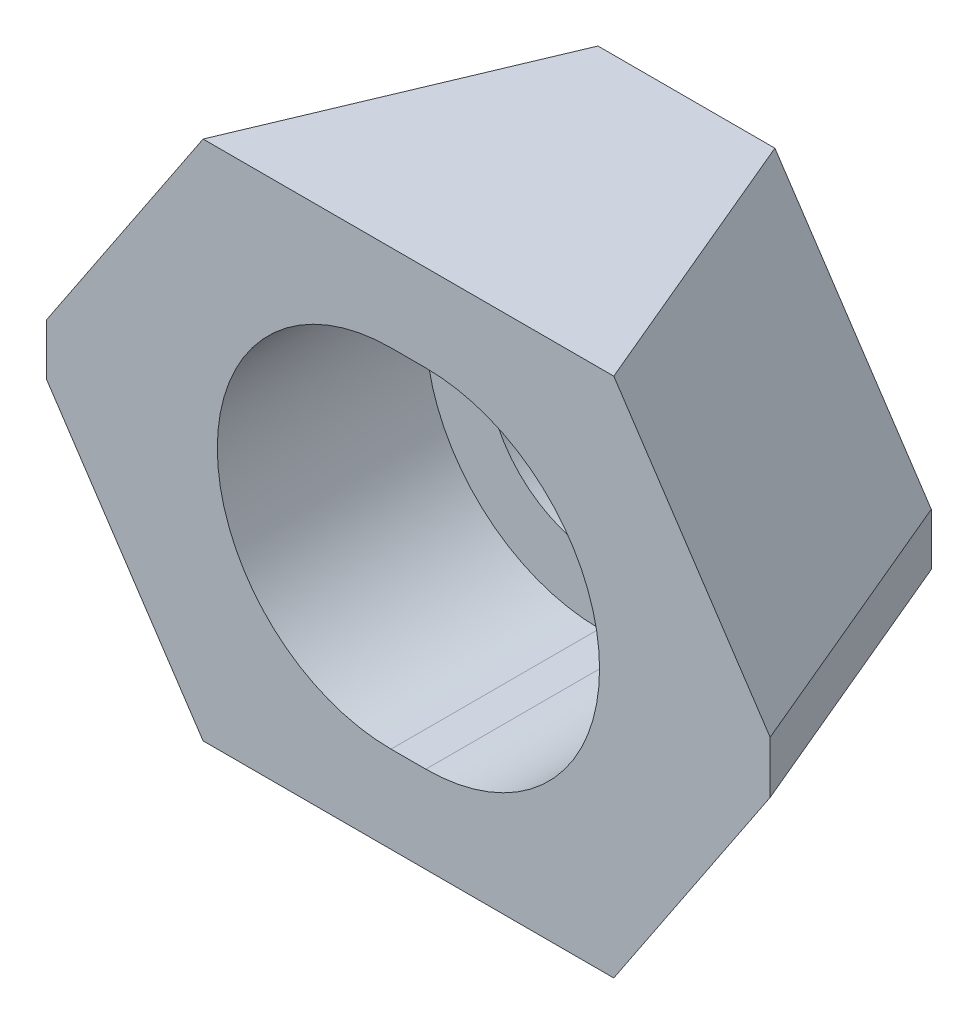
ISO-10303-21;
HEADER;
FILE_DESCRIPTION(('STEP AP214'),'2;1');
FILE_NAME('part.step','',(''),(''),'','','');
FILE_SCHEMA(('AUTOMOTIVE_DESIGN { 1 0 10303 214 1 1 1 1 }'));
ENDSEC;
DATA;
#1=APPLICATION_CONTEXT('core data for automotive mechanical design processes');
#2=APPLICATION_PROTOCOL_DEFINITION('international standard','automotive_design',2000,#1);
#3=PRODUCT_CONTEXT('',#1,'mechanical');
#4=PRODUCT('Part','Part','',(#3));
#5=PRODUCT_RELATED_PRODUCT_CATEGORY('part','',(#4));
#6=PRODUCT_DEFINITION_FORMATION('','',#4);
#7=PRODUCT_DEFINITION_CONTEXT('part definition',#1,'design');
#8=PRODUCT_DEFINITION('design','',#6,#7);
#9=PRODUCT_DEFINITION_SHAPE('','',#8);
#10=(LENGTH_UNIT() NAMED_UNIT(*) SI_UNIT(.MILLI.,.METRE.));
#11=(NAMED_UNIT(*) PLANE_ANGLE_UNIT() SI_UNIT($,.RADIAN.));
#12=(NAMED_UNIT(*) SI_UNIT($,.STERADIAN.) SOLID_ANGLE_UNIT());
#13=UNCERTAINTY_MEASURE_WITH_UNIT(LENGTH_MEASURE(1.E-05),#10,'distance_accuracy_value','');
#14=(GEOMETRIC_REPRESENTATION_CONTEXT(3) GLOBAL_UNCERTAINTY_ASSIGNED_CONTEXT((#13)) GLOBAL_UNIT_ASSIGNED_CONTEXT((#10,
#11,#12)) REPRESENTATION_CONTEXT('',''));
#15=CARTESIAN_POINT('',(0.,0.,0.));
#16=DIRECTION('',(0.,0.,1.));
#17=DIRECTION('',(1.,0.,0.));
#18=AXIS2_PLACEMENT_3D('',#15,#16,#17);
#19=CARTESIAN_POINT('',(-1.,0.,0.));
#20=DIRECTION('',(0.,0.,1.));
#21=DIRECTION('',(1.,0.,0.));
#22=AXIS2_PLACEMENT_3D('',#19,#20,#21);
#23=CYLINDRICAL_SURFACE('',#22,6.5);
#24=CARTESIAN_POINT('',(-1.,0.,4.));
#25=DIRECTION('',(0.,0.,1.));
#26=DIRECTION('',(1.,0.,0.));
#27=AXIS2_PLACEMENT_3D('',#24,#25,#26);
#28=CIRCLE('',#27,6.5);
#29=CARTESIAN_POINT('',(-1.,-6.5,4.));
#30=VERTEX_POINT('',#29);
#31=CARTESIAN_POINT('',(-1.,6.5,4.));
#32=VERTEX_POINT('',#31);
#33=EDGE_CURVE('E169',#30,#32,#28,.F.);
#34=ORIENTED_EDGE('',*,*,#33,.F.);
#35=DIRECTION('',(0.,0.,1.));
#36=VECTOR('',#35,1.);
#37=CARTESIAN_POINT('',(-1.,-6.5,0.));
#38=LINE('',#37,#36);
#39=CARTESIAN_POINT('',(-1.,-6.5,0.));
#40=VERTEX_POINT('',#39);
#41=EDGE_CURVE('E175',#40,#30,#38,.T.);
#42=ORIENTED_EDGE('',*,*,#41,.F.);
#43=CARTESIAN_POINT('',(-1.,0.,0.));
#44=DIRECTION('',(0.,0.,1.));
#45=DIRECTION('',(1.,0.,0.));
#46=AXIS2_PLACEMENT_3D('',#43,#44,#45);
#47=CIRCLE('',#46,6.5);
#48=CARTESIAN_POINT('',(-1.,6.5,0.));
#49=VERTEX_POINT('',#48);
#50=EDGE_CURVE('E172',#49,#40,#47,.T.);
#51=ORIENTED_EDGE('',*,*,#50,.F.);
#52=DIRECTION('',(0.,0.,1.));
#53=VECTOR('',#52,1.);
#54=CARTESIAN_POINT('',(-1.,6.5,0.));
#55=LINE('',#54,#53);
#56=EDGE_CURVE('E192',#49,#32,#55,.T.);
#57=ORIENTED_EDGE('',*,*,#56,.T.);
#58=EDGE_LOOP('',(#34,#42,#51,#57));
#59=FACE_BOUND('',#58,.T.);
#60=ADVANCED_FACE('F14',(#59),#23,.F.);
#61=CARTESIAN_POINT('',(-1.,6.5,0.));
#62=DIRECTION('',(0.,-1.,0.));
#63=DIRECTION('',(1.,0.,0.));
#64=AXIS2_PLACEMENT_3D('',#61,#62,#63);
#65=PLANE('',#64);
#66=DIRECTION('',(0.,0.,1.));
#67=VECTOR('',#66,1.);
#68=CARTESIAN_POINT('',(1.,6.5,0.));
#69=LINE('',#68,#67);
#70=CARTESIAN_POINT('',(1.,6.5,0.));
#71=VERTEX_POINT('',#70);
#72=CARTESIAN_POINT('',(1.,6.5,4.));
#73=VERTEX_POINT('',#72);
#74=EDGE_CURVE('E189',#71,#73,#69,.T.);
#75=ORIENTED_EDGE('',*,*,#74,.T.);
#76=DIRECTION('',(-1.,0.,0.));
#77=VECTOR('',#76,1.);
#78=CARTESIAN_POINT('',(-1.,6.5,4.));
#79=LINE('',#78,#77);
#80=EDGE_CURVE('E166',#73,#32,#79,.T.);
#81=ORIENTED_EDGE('',*,*,#80,.T.);
#82=ORIENTED_EDGE('',*,*,#56,.F.);
#83=DIRECTION('',(1.,0.,0.));
#84=VECTOR('',#83,1.);
#85=CARTESIAN_POINT('',(-1.,6.5,0.));
#86=LINE('',#85,#84);
#87=EDGE_CURVE('E171',#49,#71,#86,.T.);
#88=ORIENTED_EDGE('',*,*,#87,.T.);
#89=EDGE_LOOP('',(#75,#81,#82,#88));
#90=FACE_BOUND('',#89,.T.);
#91=ADVANCED_FACE('F304',(#90),#65,.T.);
#92=CARTESIAN_POINT('',(1.,0.,0.));
#93=DIRECTION('',(0.,0.,1.));
#94=DIRECTION('',(1.,0.,0.));
#95=AXIS2_PLACEMENT_3D('',#92,#93,#94);
#96=CYLINDRICAL_SURFACE('',#95,6.5);
#97=CARTESIAN_POINT('',(1.,0.,4.));
#98=DIRECTION('',(0.,0.,1.));
#99=DIRECTION('',(1.,0.,0.));
#100=AXIS2_PLACEMENT_3D('',#97,#98,#99);
#101=CIRCLE('',#100,6.5);
#102=CARTESIAN_POINT('',(1.00000000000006,-6.5,4.));
#103=VERTEX_POINT('',#102);
#104=EDGE_CURVE('E36',#73,#103,#101,.F.);
#105=ORIENTED_EDGE('',*,*,#104,.F.);
#106=ORIENTED_EDGE('',*,*,#74,.F.);
#107=CARTESIAN_POINT('',(1.,0.,0.));
#108=DIRECTION('',(0.,0.,1.));
#109=DIRECTION('',(1.,0.,0.));
#110=AXIS2_PLACEMENT_3D('',#107,#108,#109);
#111=CIRCLE('',#110,6.5);
#112=CARTESIAN_POINT('',(1.00000000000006,-6.5,0.));
#113=VERTEX_POINT('',#112);
#114=EDGE_CURVE('E179',#113,#71,#111,.T.);
#115=ORIENTED_EDGE('',*,*,#114,.F.);
#116=DIRECTION('',(0.,0.,1.));
#117=VECTOR('',#116,1.);
#118=CARTESIAN_POINT('',(1.00000000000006,-6.5,0.));
#119=LINE('',#118,#117);
#120=EDGE_CURVE('E186',#113,#103,#119,.T.);
#121=ORIENTED_EDGE('',*,*,#120,.T.);
#122=EDGE_LOOP('',(#105,#106,#115,#121));
#123=FACE_BOUND('',#122,.T.);
#124=ADVANCED_FACE('F311',(#123),#96,.F.);
#125=CARTESIAN_POINT('',(-1.,-6.5,0.));
#126=DIRECTION('',(0.,-1.,0.));
#127=DIRECTION('',(1.,0.,0.));
#128=AXIS2_PLACEMENT_3D('',#125,#126,#127);
#129=PLANE('',#128);
#130=DIRECTION('',(-1.,0.,0.));
#131=VECTOR('',#130,1.);
#132=CARTESIAN_POINT('',(-1.,-6.5,4.));
#133=LINE('',#132,#131);
#134=EDGE_CURVE('E9',#103,#30,#133,.T.);
#135=ORIENTED_EDGE('',*,*,#134,.F.);
#136=ORIENTED_EDGE('',*,*,#120,.F.);
#137=DIRECTION('',(1.,0.,0.));
#138=VECTOR('',#137,1.);
#139=CARTESIAN_POINT('',(-1.,-6.5,0.));
#140=LINE('',#139,#138);
#141=EDGE_CURVE('E176',#40,#113,#140,.T.);
#142=ORIENTED_EDGE('',*,*,#141,.F.);
#143=ORIENTED_EDGE('',*,*,#41,.T.);
#144=EDGE_LOOP('',(#135,#136,#142,#143));
#145=FACE_BOUND('',#144,.T.);
#146=ADVANCED_FACE('F318',(#145),#129,.F.);
#147=CARTESIAN_POINT('',(-11.8185548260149,15.,16.));
#148=DIRECTION('',(0.,-1.,0.));
#149=DIRECTION('',(0.,0.,-1.));
#150=AXIS2_PLACEMENT_3D('',#147,#148,#149);
#151=PLANE('',#150);
#152=DIRECTION('',(0.387515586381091,0.,-0.921863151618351));
#153=VECTOR('',#152,1.);
#154=CARTESIAN_POINT('',(-11.8185548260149,15.,16.));
#155=LINE('',#154,#153);
#156=CARTESIAN_POINT('',(-11.8185548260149,15.,16.));
#157=VERTEX_POINT('',#156);
#158=CARTESIAN_POINT('',(-5.09277413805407,15.,0.));
#159=VERTEX_POINT('',#158);
#160=EDGE_CURVE('E247',#157,#159,#155,.T.);
#161=ORIENTED_EDGE('',*,*,#160,.F.);
#162=DIRECTION('',(1.,0.,0.));
#163=VECTOR('',#162,1.);
#164=CARTESIAN_POINT('',(-11.8185548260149,15.,16.));
#165=LINE('',#164,#163);
#166=CARTESIAN_POINT('',(11.8185548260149,15.,16.));
#167=VERTEX_POINT('',#166);
#168=EDGE_CURVE('E22',#157,#167,#165,.T.);
#169=ORIENTED_EDGE('',*,*,#168,.T.);
#170=DIRECTION('',(-0.387515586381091,0.,-0.921863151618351));
#171=VECTOR('',#170,1.);
#172=CARTESIAN_POINT('',(11.8185548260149,15.,16.));
#173=LINE('',#172,#171);
#174=CARTESIAN_POINT('',(5.09277413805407,15.,0.));
#175=VERTEX_POINT('',#174);
#176=EDGE_CURVE('E252',#167,#175,#173,.T.);
#177=ORIENTED_EDGE('',*,*,#176,.T.);
#178=DIRECTION('',(-1.,0.,0.));
#179=VECTOR('',#178,1.);
#180=CARTESIAN_POINT('',(5.09277413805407,15.,0.));
#181=LINE('',#180,#179);
#182=EDGE_CURVE('E250',#175,#159,#181,.T.);
#183=ORIENTED_EDGE('',*,*,#182,.T.);
#184=EDGE_LOOP('',(#161,#169,#177,#183));
#185=FACE_BOUND('',#184,.T.);
#186=ADVANCED_FACE('F16',(#185),#151,.F.);
#187=CARTESIAN_POINT('',(-5.09277413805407,15.,0.));
#188=DIRECTION('',(0.,0.,-1.));
#189=DIRECTION('',(0.,1.,0.));
#190=AXIS2_PLACEMENT_3D('',#187,#188,#189);
#191=PLANE('',#190);
#192=ORIENTED_EDGE('',*,*,#50,.T.);
#193=ORIENTED_EDGE('',*,*,#141,.T.);
#194=ORIENTED_EDGE('',*,*,#114,.T.);
#195=ORIENTED_EDGE('',*,*,#87,.F.);
#196=EDGE_LOOP('',(#192,#193,#194,#195));
#197=FACE_BOUND('',#196,.T.);
#198=ORIENTED_EDGE('',*,*,#182,.F.);
#199=DIRECTION('',(0.554700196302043,-0.832050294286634,0.));
#200=VECTOR('',#199,1.);
#201=CARTESIAN_POINT('',(5.09277413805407,15.,0.));
#202=LINE('',#201,#200);
#203=CARTESIAN_POINT('',(14.0927741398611,1.5,0.));
#204=VERTEX_POINT('',#203);
#205=EDGE_CURVE('E244',#175,#204,#202,.T.);
#206=ORIENTED_EDGE('',*,*,#205,.T.);
#207=DIRECTION('',(0.,1.,0.));
#208=VECTOR('',#207,1.);
#209=CARTESIAN_POINT('',(14.0927741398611,-1.5,0.));
#210=LINE('',#209,#208);
#211=CARTESIAN_POINT('',(14.0927741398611,-1.5,0.));
#212=VERTEX_POINT('',#211);
#213=EDGE_CURVE('E227',#212,#204,#210,.T.);
#214=ORIENTED_EDGE('',*,*,#213,.F.);
#215=DIRECTION('',(-0.554700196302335,-0.83205029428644,0.));
#216=VECTOR('',#215,1.);
#217=CARTESIAN_POINT('',(14.0927741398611,-1.5,0.));
#218=LINE('',#217,#216);
#219=CARTESIAN_POINT('',(5.09277413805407,-15.,0.));
#220=VERTEX_POINT('',#219);
#221=EDGE_CURVE('E213',#212,#220,#218,.T.);
#222=ORIENTED_EDGE('',*,*,#221,.T.);
#223=DIRECTION('',(-1.,0.,0.));
#224=VECTOR('',#223,1.);
#225=CARTESIAN_POINT('',(5.09277413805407,-15.,0.));
#226=LINE('',#225,#224);
#227=CARTESIAN_POINT('',(-5.09277413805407,-15.,0.));
#228=VERTEX_POINT('',#227);
#229=EDGE_CURVE('E202',#220,#228,#226,.T.);
#230=ORIENTED_EDGE('',*,*,#229,.T.);
#231=DIRECTION('',(0.554700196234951,-0.832050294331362,0.));
#232=VECTOR('',#231,1.);
#233=CARTESIAN_POINT('',(-14.0927741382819,-1.5,0.));
#234=LINE('',#233,#232);
#235=CARTESIAN_POINT('',(-14.0927741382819,-1.5,0.));
#236=VERTEX_POINT('',#235);
#237=EDGE_CURVE('E212',#236,#228,#234,.T.);
#238=ORIENTED_EDGE('',*,*,#237,.F.);
#239=DIRECTION('',(0.,1.,0.));
#240=VECTOR('',#239,1.);
#241=CARTESIAN_POINT('',(-14.0927741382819,-1.5,0.));
#242=LINE('',#241,#240);
#243=CARTESIAN_POINT('',(-14.0927741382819,1.5,0.));
#244=VERTEX_POINT('',#243);
#245=EDGE_CURVE('E229',#236,#244,#242,.T.);
#246=ORIENTED_EDGE('',*,*,#245,.T.);
#247=DIRECTION('',(-0.554700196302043,-0.832050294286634,0.));
#248=VECTOR('',#247,1.);
#249=CARTESIAN_POINT('',(-5.09277413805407,15.,0.));
#250=LINE('',#249,#248);
#251=EDGE_CURVE('E243',#159,#244,#250,.T.);
#252=ORIENTED_EDGE('',*,*,#251,.F.);
#253=EDGE_LOOP('',(#198,#206,#214,#222,#230,#238,#246,#252));
#254=FACE_BOUND('',#253,.T.);
#255=ADVANCED_FACE('F267',(#197,#254),#191,.T.);
#256=CARTESIAN_POINT('',(5.09277413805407,15.,0.));
#257=DIRECTION('',(0.785395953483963,0.523597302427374,-0.330150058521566));
#258=DIRECTION('',(-0.554700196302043,0.832050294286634,0.));
#259=AXIS2_PLACEMENT_3D('',#256,#257,#258);
#260=PLANE('',#259);
#261=ORIENTED_EDGE('',*,*,#176,.F.);
#262=DIRECTION('',(0.55470019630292,-0.83205029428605,0.));
#263=VECTOR('',#262,1.);
#264=CARTESIAN_POINT('',(11.8185548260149,15.,16.));
#265=LINE('',#264,#263);
#266=CARTESIAN_POINT('',(20.8185548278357,1.5,16.));
#267=VERTEX_POINT('',#266);
#268=EDGE_CURVE('E240',#167,#267,#265,.T.);
#269=ORIENTED_EDGE('',*,*,#268,.T.);
#270=DIRECTION('',(-0.387515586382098,0.,-0.921863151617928));
#271=VECTOR('',#270,1.);
#272=CARTESIAN_POINT('',(20.8185548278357,1.5,16.));
#273=LINE('',#272,#271);
#274=EDGE_CURVE('E232',#267,#204,#273,.T.);
#275=ORIENTED_EDGE('',*,*,#274,.T.);
#276=ORIENTED_EDGE('',*,*,#205,.F.);
#277=EDGE_LOOP('',(#261,#269,#275,#276));
#278=FACE_BOUND('',#277,.T.);
#279=ADVANCED_FACE('F275',(#278),#260,.T.);
#280=CARTESIAN_POINT('',(-11.8185548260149,15.,16.));
#281=DIRECTION('',(-0.785395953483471,0.523597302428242,-0.33015005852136));
#282=DIRECTION('',(-0.55470019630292,-0.83205029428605,0.));
#283=AXIS2_PLACEMENT_3D('',#280,#281,#282);
#284=PLANE('',#283);
#285=ORIENTED_EDGE('',*,*,#160,.T.);
#286=ORIENTED_EDGE('',*,*,#251,.T.);
#287=DIRECTION('',(0.387515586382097,0.,-0.921863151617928));
#288=VECTOR('',#287,1.);
#289=CARTESIAN_POINT('',(-20.8185548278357,1.5,16.));
#290=LINE('',#289,#288);
#291=CARTESIAN_POINT('',(-20.8185548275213,1.5,16.));
#292=VERTEX_POINT('',#291);
#293=EDGE_CURVE('E231',#292,#244,#290,.T.);
#294=ORIENTED_EDGE('',*,*,#293,.F.);
#295=DIRECTION('',(-0.55470019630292,-0.83205029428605,0.));
#296=VECTOR('',#295,1.);
#297=CARTESIAN_POINT('',(-11.8185548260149,15.,16.));
#298=LINE('',#297,#296);
#299=EDGE_CURVE('E235',#157,#292,#298,.T.);
#300=ORIENTED_EDGE('',*,*,#299,.F.);
#301=EDGE_LOOP('',(#285,#286,#294,#300));
#302=FACE_BOUND('',#301,.T.);
#303=ADVANCED_FACE('F258',(#302),#284,.T.);
#304=CARTESIAN_POINT('',(11.8185548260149,15.,16.));
#305=DIRECTION('',(0.,0.,1.));
#306=DIRECTION('',(1.,0.,0.));
#307=AXIS2_PLACEMENT_3D('',#304,#305,#306);
#308=PLANE('',#307);
#309=CARTESIAN_POINT('',(-1.,0.,16.));
#310=DIRECTION('',(0.,0.,1.));
#311=DIRECTION('',(1.,0.,0.));
#312=AXIS2_PLACEMENT_3D('',#309,#310,#311);
#313=CIRCLE('',#312,10.);
#314=CARTESIAN_POINT('',(-1.,10.,16.));
#315=VERTEX_POINT('',#314);
#316=CARTESIAN_POINT('',(-1.,-10.,16.));
#317=VERTEX_POINT('',#316);
#318=EDGE_CURVE('E29',#315,#317,#313,.T.);
#319=ORIENTED_EDGE('',*,*,#318,.F.);
#320=DIRECTION('',(1.,0.,0.));
#321=VECTOR('',#320,1.);
#322=CARTESIAN_POINT('',(-1.,10.,16.));
#323=LINE('',#322,#321);
#324=CARTESIAN_POINT('',(1.,10.,16.));
#325=VERTEX_POINT('',#324);
#326=EDGE_CURVE('E135',#315,#325,#323,.T.);
#327=ORIENTED_EDGE('',*,*,#326,.T.);
#328=CARTESIAN_POINT('',(1.,0.,16.));
#329=DIRECTION('',(0.,0.,1.));
#330=DIRECTION('',(1.,0.,0.));
#331=AXIS2_PLACEMENT_3D('',#328,#329,#330);
#332=CIRCLE('',#331,10.);
#333=CARTESIAN_POINT('',(1.,-10.,16.));
#334=VERTEX_POINT('',#333);
#335=EDGE_CURVE('E140',#334,#325,#332,.T.);
#336=ORIENTED_EDGE('',*,*,#335,.F.);
#337=DIRECTION('',(1.,0.,0.));
#338=VECTOR('',#337,1.);
#339=CARTESIAN_POINT('',(-1.,-10.,16.));
#340=LINE('',#339,#338);
#341=EDGE_CURVE('E146',#317,#334,#340,.T.);
#342=ORIENTED_EDGE('',*,*,#341,.F.);
#343=EDGE_LOOP('',(#319,#327,#336,#342));
#344=FACE_BOUND('',#343,.T.);
#345=ORIENTED_EDGE('',*,*,#168,.F.);
#346=ORIENTED_EDGE('',*,*,#299,.T.);
#347=DIRECTION('',(0.,1.,0.));
#348=VECTOR('',#347,1.);
#349=CARTESIAN_POINT('',(-20.8185548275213,-1.5,16.));
#350=LINE('',#349,#348);
#351=CARTESIAN_POINT('',(-20.8185548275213,-1.5,16.));
#352=VERTEX_POINT('',#351);
#353=EDGE_CURVE('E220',#352,#292,#350,.T.);
#354=ORIENTED_EDGE('',*,*,#353,.F.);
#355=DIRECTION('',(0.554700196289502,-0.832050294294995,0.));
#356=VECTOR('',#355,1.);
#357=CARTESIAN_POINT('',(-20.8185548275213,-1.5,16.));
#358=LINE('',#357,#356);
#359=CARTESIAN_POINT('',(-11.8185548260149,-15.,16.));
#360=VERTEX_POINT('',#359);
#361=EDGE_CURVE('E198',#352,#360,#358,.T.);
#362=ORIENTED_EDGE('',*,*,#361,.T.);
#363=DIRECTION('',(1.,0.,0.));
#364=VECTOR('',#363,1.);
#365=CARTESIAN_POINT('',(-11.8185548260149,-15.,16.));
#366=LINE('',#365,#364);
#367=CARTESIAN_POINT('',(11.8185548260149,-15.,16.));
#368=VERTEX_POINT('',#367);
#369=EDGE_CURVE('E196',#360,#368,#366,.T.);
#370=ORIENTED_EDGE('',*,*,#369,.T.);
#371=DIRECTION('',(-0.554700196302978,-0.832050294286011,0.));
#372=VECTOR('',#371,1.);
#373=CARTESIAN_POINT('',(20.8185548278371,-1.5,16.));
#374=LINE('',#373,#372);
#375=CARTESIAN_POINT('',(20.8185548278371,-1.5,16.));
#376=VERTEX_POINT('',#375);
#377=EDGE_CURVE('E209',#376,#368,#374,.T.);
#378=ORIENTED_EDGE('',*,*,#377,.F.);
#379=DIRECTION('',(0.,1.,0.));
#380=VECTOR('',#379,1.);
#381=CARTESIAN_POINT('',(20.8185548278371,-1.5,16.));
#382=LINE('',#381,#380);
#383=EDGE_CURVE('E224',#376,#267,#382,.T.);
#384=ORIENTED_EDGE('',*,*,#383,.T.);
#385=ORIENTED_EDGE('',*,*,#268,.F.);
#386=EDGE_LOOP('',(#345,#346,#354,#362,#370,#378,#384,#385));
#387=FACE_BOUND('',#386,.T.);
#388=ADVANCED_FACE('F143',(#344,#387),#308,.T.);
#389=CARTESIAN_POINT('',(-20.8185548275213,-1.5,16.));
#390=DIRECTION('',(0.921863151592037,0.,0.387515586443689));
#391=DIRECTION('',(0.387515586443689,0.,-0.921863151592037));
#392=AXIS2_PLACEMENT_3D('',#389,#390,#391);
#393=PLANE('',#392);
#394=ORIENTED_EDGE('',*,*,#245,.F.);
#395=DIRECTION('',(0.387515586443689,0.,-0.921863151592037));
#396=VECTOR('',#395,1.);
#397=CARTESIAN_POINT('',(-20.8185548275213,-1.5,16.));
#398=LINE('',#397,#396);
#399=EDGE_CURVE('E217',#352,#236,#398,.T.);
#400=ORIENTED_EDGE('',*,*,#399,.F.);
#401=ORIENTED_EDGE('',*,*,#353,.T.);
#402=ORIENTED_EDGE('',*,*,#293,.T.);
#403=EDGE_LOOP('',(#394,#400,#401,#402));
#404=FACE_BOUND('',#403,.T.);
#405=ADVANCED_FACE('F271',(#404),#393,.F.);
#406=CARTESIAN_POINT('',(20.8185548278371,-1.5,16.));
#407=DIRECTION('',(0.92186315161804,0.,-0.38751558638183));
#408=DIRECTION('',(-0.38751558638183,0.,-0.921863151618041));
#409=AXIS2_PLACEMENT_3D('',#406,#407,#408);
#410=PLANE('',#409);
#411=ORIENTED_EDGE('',*,*,#383,.F.);
#412=DIRECTION('',(-0.38751558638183,0.,-0.921863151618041));
#413=VECTOR('',#412,1.);
#414=CARTESIAN_POINT('',(20.8185548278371,-1.5,16.));
#415=LINE('',#414,#413);
#416=EDGE_CURVE('E215',#376,#212,#415,.T.);
#417=ORIENTED_EDGE('',*,*,#416,.T.);
#418=ORIENTED_EDGE('',*,*,#213,.T.);
#419=ORIENTED_EDGE('',*,*,#274,.F.);
#420=EDGE_LOOP('',(#411,#417,#418,#419));
#421=FACE_BOUND('',#420,.T.);
#422=ADVANCED_FACE('F279',(#421),#410,.T.);
#423=CARTESIAN_POINT('',(-11.8185548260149,-15.,16.));
#424=DIRECTION('',(0.,-1.,0.));
#425=DIRECTION('',(0.,0.,-1.));
#426=AXIS2_PLACEMENT_3D('',#423,#424,#425);
#427=PLANE('',#426);
#428=DIRECTION('',(0.387515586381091,0.,-0.921863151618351));
#429=VECTOR('',#428,1.);
#430=CARTESIAN_POINT('',(-11.8185548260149,-15.,16.));
#431=LINE('',#430,#429);
#432=EDGE_CURVE('E195',#360,#228,#431,.T.);
#433=ORIENTED_EDGE('',*,*,#432,.T.);
#434=ORIENTED_EDGE('',*,*,#229,.F.);
#435=DIRECTION('',(-0.387515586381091,0.,-0.921863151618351));
#436=VECTOR('',#435,1.);
#437=CARTESIAN_POINT('',(11.8185548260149,-15.,16.));
#438=LINE('',#437,#436);
#439=EDGE_CURVE('E199',#368,#220,#438,.T.);
#440=ORIENTED_EDGE('',*,*,#439,.F.);
#441=ORIENTED_EDGE('',*,*,#369,.F.);
#442=EDGE_LOOP('',(#433,#434,#440,#441));
#443=FACE_BOUND('',#442,.T.);
#444=ADVANCED_FACE('F285',(#443),#427,.T.);
#445=CARTESIAN_POINT('',(14.0927741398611,-1.5,0.));
#446=DIRECTION('',(0.785395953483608,-0.523597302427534,-0.330150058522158));
#447=DIRECTION('',(0.554700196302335,0.83205029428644,0.));
#448=AXIS2_PLACEMENT_3D('',#445,#446,#447);
#449=PLANE('',#448);
#450=ORIENTED_EDGE('',*,*,#416,.F.);
#451=ORIENTED_EDGE('',*,*,#377,.T.);
#452=ORIENTED_EDGE('',*,*,#439,.T.);
#453=ORIENTED_EDGE('',*,*,#221,.F.);
#454=EDGE_LOOP('',(#450,#451,#452,#453));
#455=FACE_BOUND('',#454,.T.);
#456=ADVANCED_FACE('F281',(#455),#449,.T.);
#457=CARTESIAN_POINT('',(-20.8185548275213,-1.5,16.));
#458=DIRECTION('',(-0.785395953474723,-0.523597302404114,-0.330150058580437));
#459=DIRECTION('',(0.554700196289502,-0.832050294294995,0.));
#460=AXIS2_PLACEMENT_3D('',#457,#458,#459);
#461=PLANE('',#460);
#462=ORIENTED_EDGE('',*,*,#399,.T.);
#463=ORIENTED_EDGE('',*,*,#237,.T.);
#464=ORIENTED_EDGE('',*,*,#432,.F.);
#465=ORIENTED_EDGE('',*,*,#361,.F.);
#466=EDGE_LOOP('',(#462,#463,#464,#465));
#467=FACE_BOUND('',#466,.T.);
#468=ADVANCED_FACE('F288',(#467),#461,.T.);
#469=CARTESIAN_POINT('',(-1.,0.,4.));
#470=DIRECTION('',(0.,0.,1.));
#471=DIRECTION('',(1.,0.,0.));
#472=AXIS2_PLACEMENT_3D('',#469,#470,#471);
#473=PLANE('',#472);
#474=CARTESIAN_POINT('',(-1.,0.,4.));
#475=DIRECTION('',(0.,0.,1.));
#476=DIRECTION('',(1.,0.,0.));
#477=AXIS2_PLACEMENT_3D('',#474,#475,#476);
#478=CIRCLE('',#477,10.);
#479=CARTESIAN_POINT('',(-1.,10.,4.));
#480=VERTEX_POINT('',#479);
#481=CARTESIAN_POINT('',(-1.,-10.,4.));
#482=VERTEX_POINT('',#481);
#483=EDGE_CURVE('E128',#480,#482,#478,.T.);
#484=ORIENTED_EDGE('',*,*,#483,.T.);
#485=DIRECTION('',(1.,0.,0.));
#486=VECTOR('',#485,1.);
#487=CARTESIAN_POINT('',(-1.,-10.,4.));
#488=LINE('',#487,#486);
#489=CARTESIAN_POINT('',(1.,-10.,4.));
#490=VERTEX_POINT('',#489);
#491=EDGE_CURVE('E156',#482,#490,#488,.T.);
#492=ORIENTED_EDGE('',*,*,#491,.T.);
#493=CARTESIAN_POINT('',(1.,0.,4.));
#494=DIRECTION('',(0.,0.,1.));
#495=DIRECTION('',(1.,0.,0.));
#496=AXIS2_PLACEMENT_3D('',#493,#494,#495);
#497=CIRCLE('',#496,10.);
#498=CARTESIAN_POINT('',(1.,10.,4.));
#499=VERTEX_POINT('',#498);
#500=EDGE_CURVE('E149',#490,#499,#497,.T.);
#501=ORIENTED_EDGE('',*,*,#500,.T.);
#502=DIRECTION('',(1.,0.,0.));
#503=VECTOR('',#502,1.);
#504=CARTESIAN_POINT('',(-1.,10.,4.));
#505=LINE('',#504,#503);
#506=EDGE_CURVE('E147',#480,#499,#505,.T.);
#507=ORIENTED_EDGE('',*,*,#506,.F.);
#508=EDGE_LOOP('',(#484,#492,#501,#507));
#509=FACE_BOUND('',#508,.T.);
#510=ORIENTED_EDGE('',*,*,#33,.T.);
#511=ORIENTED_EDGE('',*,*,#80,.F.);
#512=ORIENTED_EDGE('',*,*,#104,.T.);
#513=ORIENTED_EDGE('',*,*,#134,.T.);
#514=EDGE_LOOP('',(#510,#511,#512,#513));
#515=FACE_BOUND('',#514,.T.);
#516=ADVANCED_FACE('F290',(#509,#515),#473,.T.);
#517=CARTESIAN_POINT('',(-1.,0.,4.));
#518=DIRECTION('',(0.,0.,1.));
#519=DIRECTION('',(1.,0.,0.));
#520=AXIS2_PLACEMENT_3D('',#517,#518,#519);
#521=CYLINDRICAL_SURFACE('',#520,10.);
#522=DIRECTION('',(0.,0.,1.));
#523=VECTOR('',#522,1.);
#524=CARTESIAN_POINT('',(-1.,10.,4.));
#525=LINE('',#524,#523);
#526=EDGE_CURVE('E124',#480,#315,#525,.T.);
#527=ORIENTED_EDGE('',*,*,#526,.T.);
#528=ORIENTED_EDGE('',*,*,#318,.T.);
#529=DIRECTION('',(0.,0.,1.));
#530=VECTOR('',#529,1.);
#531=CARTESIAN_POINT('',(-1.,-10.,4.));
#532=LINE('',#531,#530);
#533=EDGE_CURVE('E155',#482,#317,#532,.T.);
#534=ORIENTED_EDGE('',*,*,#533,.F.);
#535=ORIENTED_EDGE('',*,*,#483,.F.);
#536=EDGE_LOOP('',(#527,#528,#534,#535));
#537=FACE_BOUND('',#536,.T.);
#538=ADVANCED_FACE('F126',(#537),#521,.F.);
#539=CARTESIAN_POINT('',(-1.,10.,4.));
#540=DIRECTION('',(0.,-1.,0.));
#541=DIRECTION('',(0.,0.,-1.));
#542=AXIS2_PLACEMENT_3D('',#539,#540,#541);
#543=PLANE('',#542);
#544=DIRECTION('',(0.,0.,1.));
#545=VECTOR('',#544,1.);
#546=CARTESIAN_POINT('',(1.,10.,4.));
#547=LINE('',#546,#545);
#548=EDGE_CURVE('E132',#499,#325,#547,.T.);
#549=ORIENTED_EDGE('',*,*,#548,.T.);
#550=ORIENTED_EDGE('',*,*,#326,.F.);
#551=ORIENTED_EDGE('',*,*,#526,.F.);
#552=ORIENTED_EDGE('',*,*,#506,.T.);
#553=EDGE_LOOP('',(#549,#550,#551,#552));
#554=FACE_BOUND('',#553,.T.);
#555=ADVANCED_FACE('F136',(#554),#543,.T.);
#556=CARTESIAN_POINT('',(1.,0.,4.));
#557=DIRECTION('',(0.,0.,1.));
#558=DIRECTION('',(1.,0.,0.));
#559=AXIS2_PLACEMENT_3D('',#556,#557,#558);
#560=CYLINDRICAL_SURFACE('',#559,10.);
#561=DIRECTION('',(0.,0.,1.));
#562=VECTOR('',#561,1.);
#563=CARTESIAN_POINT('',(1.,-10.,4.));
#564=LINE('',#563,#562);
#565=EDGE_CURVE('E162',#490,#334,#564,.T.);
#566=ORIENTED_EDGE('',*,*,#565,.T.);
#567=ORIENTED_EDGE('',*,*,#335,.T.);
#568=ORIENTED_EDGE('',*,*,#548,.F.);
#569=ORIENTED_EDGE('',*,*,#500,.F.);
#570=EDGE_LOOP('',(#566,#567,#568,#569));
#571=FACE_BOUND('',#570,.T.);
#572=ADVANCED_FACE('F443',(#571),#560,.F.);
#573=CARTESIAN_POINT('',(-1.,-10.,4.));
#574=DIRECTION('',(0.,-1.,0.));
#575=DIRECTION('',(0.,0.,-1.));
#576=AXIS2_PLACEMENT_3D('',#573,#574,#575);
#577=PLANE('',#576);
#578=ORIENTED_EDGE('',*,*,#491,.F.);
#579=ORIENTED_EDGE('',*,*,#533,.T.);
#580=ORIENTED_EDGE('',*,*,#341,.T.);
#581=ORIENTED_EDGE('',*,*,#565,.F.);
#582=EDGE_LOOP('',(#578,#579,#580,#581));
#583=FACE_BOUND('',#582,.T.);
#584=ADVANCED_FACE('F450',(#583),#577,.F.);
#585=CLOSED_SHELL('',(#60,#91,#124,#146,#186,#255,#279,#303,#388,#405,#422,#444,#456,#468,#516,
#538,#555,#572,#584));
#586=MANIFOLD_SOLID_BREP('B1',#585);
#587=ADVANCED_BREP_SHAPE_REPRESENTATION('',(#18,#586),#14);
#588=SHAPE_DEFINITION_REPRESENTATION(#9,#587);
ENDSEC;
END-ISO-10303-21;
